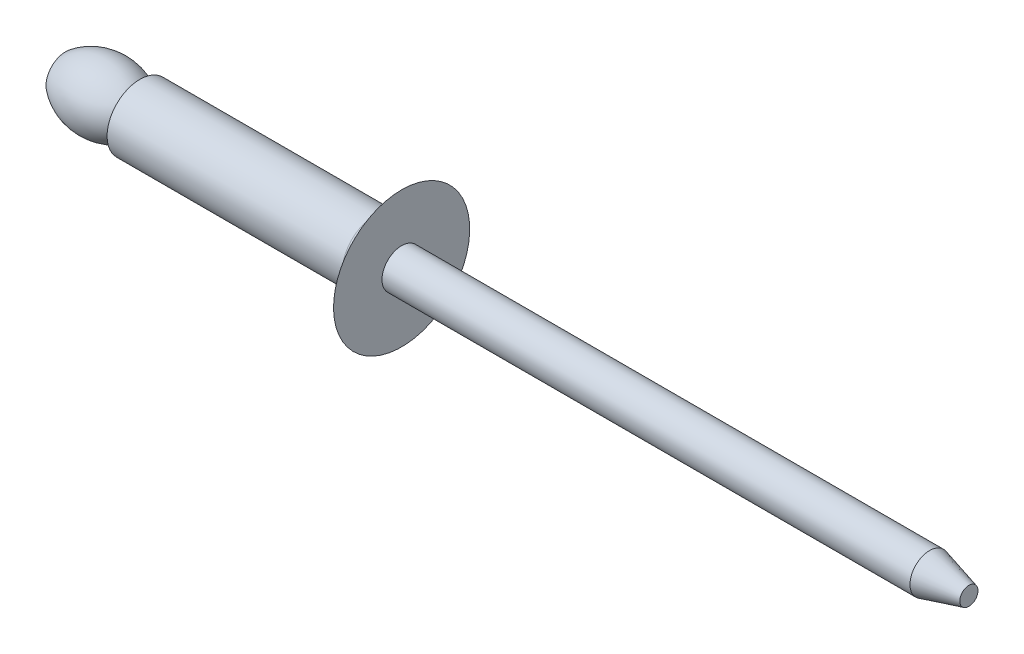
from build123d import *

# Parameters (mm, degrees)
FILLET1_R      = 0.5
CHAMFER1_SIZE  = 1.8
CHAMFER1_SIZE2 = 0.482308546


with BuildPart() as part:
    # Sketch1 → Base-Revolve (revolve)
    with BuildSketch(Plane(origin=(-30.238360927, 33.358360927, 0), x_dir=(0, -1, 0), z_dir=(0, 0, 1)), mode=Mode.PRIVATE) as base_revolve_sk:
        with BuildLine():
            Line((34.258360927, 33.638360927), (34.858360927, 33.638360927))
            Line((34.858360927, 33.638360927), (34.858360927, 44.703053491))
            Line((34.858360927, 44.703053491), (36.478360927, 45.638360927))
            Line((36.478360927, 45.638360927), (34.258360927, 45.638360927))
            Line((34.258360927, 45.638360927), (34.258360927, 71.638360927))
            Line((34.258360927, 71.638360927), (33.358360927, 71.638360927))
            Line((33.358360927, 71.638360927), (33.358360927, 30.238360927))
            Line((33.358360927, 30.238360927), (34.258360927, 30.238360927))
            ThreePointArc((34.258360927, 30.238360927), (34.858360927, 31.938360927), (34.258360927, 33.638360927))
        make_face()
    revolve(base_revolve_sk.sketch.rotate(Axis((43.645120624, 0, 0), (-1, 0, 0)), 180), axis=Axis((43.645120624, 0, 0), (-1, 0, 0)))

    # Fillet1
    fillet1_edges = [part.edges().sort_by_distance(p)[0] for p in [
        (14.464692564, -1.5, 0),
    ]]
    fillet(fillet1_edges, radius=FILLET1_R)

    # Chamfer1
    chamfer1_edges = [part.edges().sort_by_distance(p)[0] for p in [
        (41.4, -0.9, 0),
    ]]
    chamfer1_side = [part.faces().sort_by_distance(p)[0] for p in [
        (28.4, -0.9, 0),
    ]]
    chamfer(chamfer1_edges, length=CHAMFER1_SIZE, length2=CHAMFER1_SIZE2, reference=chamfer1_side[0])


solid = part.part
